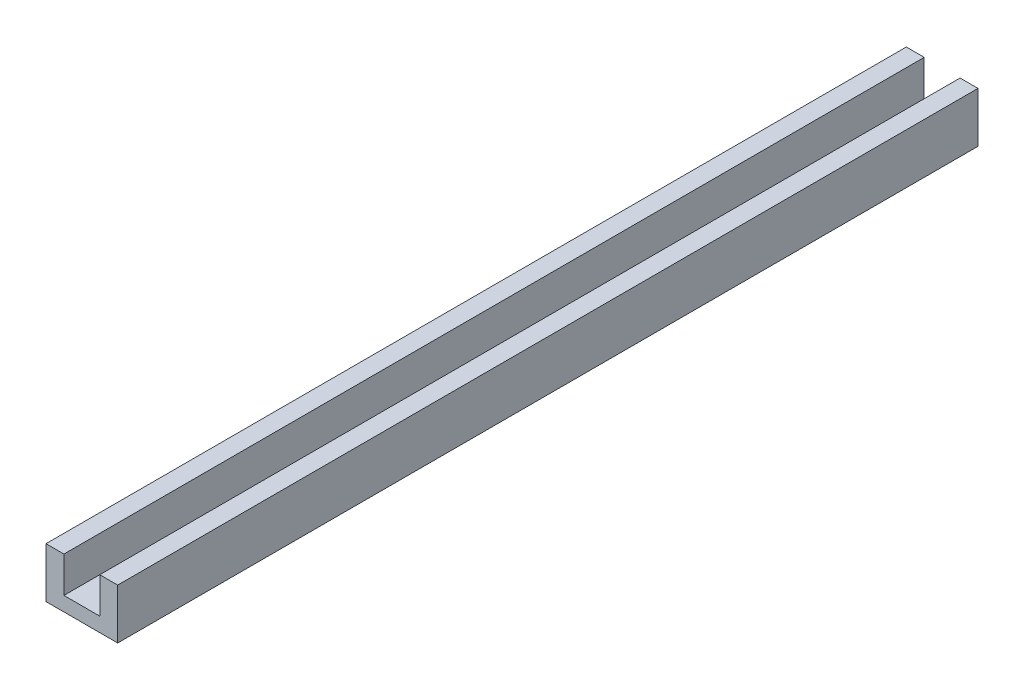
from build123d import *

# Parameters (mm, degrees)
BOSS_EXTRUDE1_DEPTH = 152.4


with BuildPart() as part:
    # Sketch1 → Boss-Extrude1 (new, symmetric)
    with BuildSketch(Plane.XY):
        Polygon((0, 0), (0, 17.78), (6.35, 17.78), (6.35, 5.08), (19.05, 5.08), (19.05, 17.78), (25.4, 17.78), (25.4, 0), align=None)
    extrude(amount=BOSS_EXTRUDE1_DEPTH, both=True)


solid = part.part
